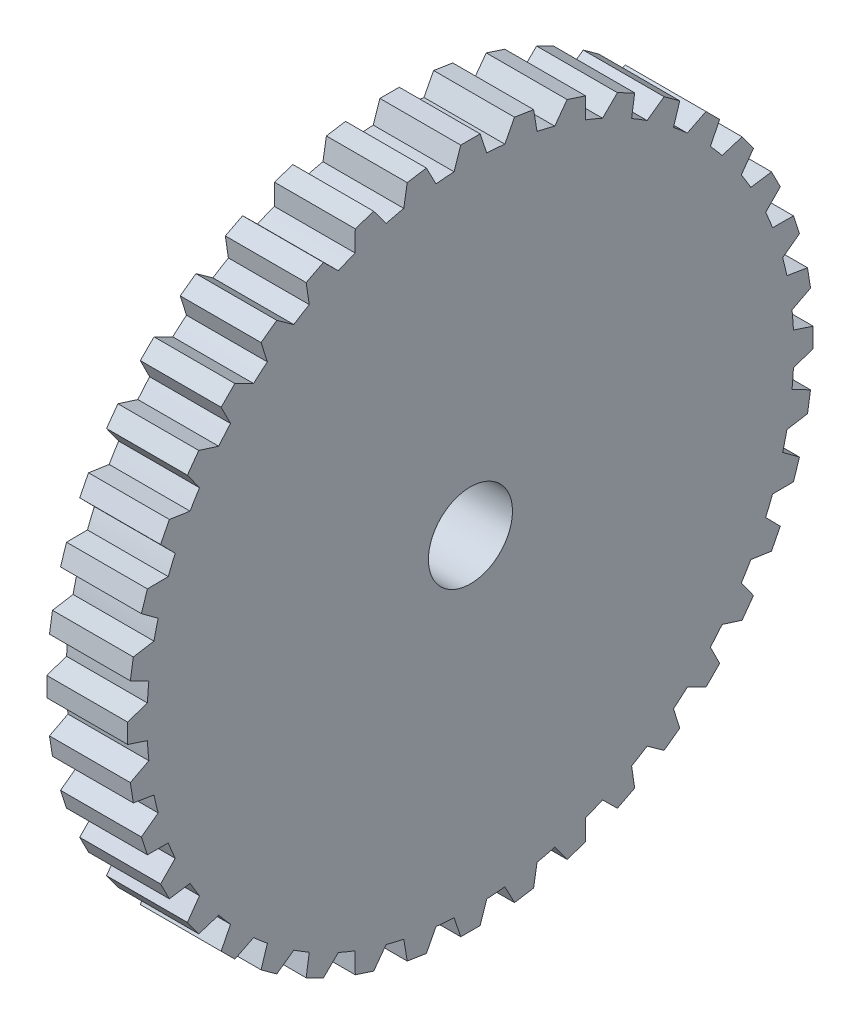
from build123d import *

# Parameters (mm, degrees)
SKETCH1_R           = 12.7
BOSS_EXTRUDE1_DEPTH = 3.175
BOSS_EXTRUDE2_DEPTH = 3.175
SKETCH3_R           = 1.651
CUT_EXTRUDE1_DEPTH  = 3.175


with BuildPart() as part:
    # Sketch1 → Boss-Extrude1 (new body)
    with BuildSketch(Plane(origin=(0, 0, 0), x_dir=(0, 0, -1), z_dir=(1, 0, 0))):
        Circle(SKETCH1_R)
    extrude(amount=BOSS_EXTRUDE1_DEPTH)

    # Sketch2 → Boss-Extrude2 (add)
    with BuildSketch(Plane(origin=(3.175, 0, 0), x_dir=(0, 0, -1), z_dir=(1, 0, 0))):
        Polygon((1.729611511, 13.355861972), (2.482230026, 13.23665891), (2.67973469, 12.048129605), (1.174497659, 12.28653573), align=None)
        Polygon((-0.762, 12.319), (0.762, 12.319), (0.381, 13.462), (-0.381, 13.462), align=None)
        Polygon((3.797634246, 12.920858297), (4.522339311, 12.685387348), (4.531485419, 11.480594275), (3.082075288, 11.951536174), align=None)
        Polygon((5.772146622, 12.167700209), (6.451093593, 11.821759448), (6.271655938, 10.630368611), (4.913761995, 11.322250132), align=None)
        Polygon((7.604529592, 11.114932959), (8.221000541, 10.667040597), (7.857397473, 9.518387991), (6.624455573, 10.414172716), align=None)
        Polygon((9.249663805, 9.788479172), (9.788479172, 9.249663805), (9.249663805, 8.17203307), (8.17203307, 9.249663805), align=None)
        Polygon((10.667040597, 8.221000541), (11.114932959, 7.604529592), (10.414172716, 6.624455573), (9.518387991, 7.857397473), align=None)
        Polygon((11.821759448, 6.451093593), (12.167700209, 5.772146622), (11.322250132, 4.913761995), (10.630368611, 6.271655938), align=None)
        Polygon((12.685387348, 4.522339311), (12.920858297, 3.797634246), (11.951536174, 3.082075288), (11.480594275, 4.531485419), align=None)
        Polygon((13.23665891, 2.482230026), (13.355861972, 1.729611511), (12.28653573, 1.174497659), (12.048129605, 2.67973469), align=None)
        Polygon((13.462, 0.381), (13.462, -0.381), (12.319, -0.762), (12.319, 0.762), align=None)
        Polygon((13.355861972, -1.729611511), (13.23665891, -2.482230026), (12.048129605, -2.67973469), (12.28653573, -1.174497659), align=None)
        Polygon((12.920858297, -3.797634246), (12.685387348, -4.522339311), (11.480594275, -4.531485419), (11.951536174, -3.082075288), align=None)
        Polygon((12.167700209, -5.772146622), (11.821759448, -6.451093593), (10.630368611, -6.271655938), (11.322250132, -4.913761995), align=None)
        Polygon((11.114932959, -7.604529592), (10.667040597, -8.221000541), (9.518387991, -7.857397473), (10.414172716, -6.624455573), align=None)
        Polygon((9.788479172, -9.249663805), (9.249663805, -9.788479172), (8.17203307, -9.249663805), (9.249663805, -8.17203307), align=None)
        Polygon((8.221000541, -10.667040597), (7.604529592, -11.114932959), (6.624455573, -10.414172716), (7.857397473, -9.518387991), align=None)
        Polygon((6.451093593, -11.821759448), (5.772146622, -12.167700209), (4.913761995, -11.322250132), (6.271655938, -10.630368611), align=None)
        Polygon((4.522339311, -12.685387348), (3.797634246, -12.920858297), (3.082075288, -11.951536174), (4.531485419, -11.480594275), align=None)
        Polygon((2.482230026, -13.23665891), (1.729611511, -13.355861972), (1.174497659, -12.28653573), (2.67973469, -12.048129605), align=None)
        Polygon((0.381, -13.462), (-0.381, -13.462), (-0.762, -12.319), (0.762, -12.319), align=None)
        Polygon((-1.729611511, -13.355861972), (-2.482230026, -13.23665891), (-2.67973469, -12.048129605), (-1.174497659, -12.28653573), align=None)
        Polygon((-3.797634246, -12.920858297), (-4.522339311, -12.685387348), (-4.531485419, -11.480594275), (-3.082075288, -11.951536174), align=None)
        Polygon((-5.772146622, -12.167700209), (-6.451093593, -11.821759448), (-6.271655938, -10.630368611), (-4.913761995, -11.322250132), align=None)
        Polygon((-7.604529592, -11.114932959), (-8.221000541, -10.667040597), (-7.857397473, -9.518387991), (-6.624455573, -10.414172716), align=None)
        Polygon((-9.249663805, -9.788479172), (-9.788479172, -9.249663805), (-9.249663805, -8.17203307), (-8.17203307, -9.249663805), align=None)
        Polygon((-10.667040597, -8.221000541), (-11.114932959, -7.604529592), (-10.414172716, -6.624455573), (-9.518387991, -7.857397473), align=None)
        Polygon((-11.821759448, -6.451093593), (-12.167700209, -5.772146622), (-11.322250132, -4.913761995), (-10.630368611, -6.271655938), align=None)
        Polygon((-12.685387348, -4.522339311), (-12.920858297, -3.797634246), (-11.951536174, -3.082075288), (-11.480594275, -4.531485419), align=None)
        Polygon((-13.23665891, -2.482230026), (-13.355861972, -1.729611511), (-12.28653573, -1.174497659), (-12.048129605, -2.67973469), align=None)
        Polygon((-13.462, -0.381), (-13.462, 0.381), (-12.319, 0.762), (-12.319, -0.762), align=None)
        Polygon((-13.355861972, 1.729611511), (-13.23665891, 2.482230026), (-12.048129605, 2.67973469), (-12.28653573, 1.174497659), align=None)
        Polygon((-12.920858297, 3.797634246), (-12.685387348, 4.522339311), (-11.480594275, 4.531485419), (-11.951536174, 3.082075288), align=None)
        Polygon((-12.167700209, 5.772146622), (-11.821759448, 6.451093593), (-10.630368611, 6.271655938), (-11.322250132, 4.913761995), align=None)
        Polygon((-11.114932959, 7.604529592), (-10.667040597, 8.221000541), (-9.518387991, 7.857397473), (-10.414172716, 6.624455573), align=None)
        Polygon((-9.788479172, 9.249663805), (-9.249663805, 9.788479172), (-8.17203307, 9.249663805), (-9.249663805, 8.17203307), align=None)
        Polygon((-8.221000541, 10.667040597), (-7.604529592, 11.114932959), (-6.624455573, 10.414172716), (-7.857397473, 9.518387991), align=None)
        Polygon((-6.451093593, 11.821759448), (-5.772146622, 12.167700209), (-4.913761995, 11.322250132), (-6.271655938, 10.630368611), align=None)
        Polygon((-4.522339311, 12.685387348), (-3.797634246, 12.920858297), (-3.082075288, 11.951536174), (-4.531485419, 11.480594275), align=None)
        Polygon((-2.482230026, 13.23665891), (-1.729611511, 13.355861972), (-1.174497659, 12.28653573), (-2.67973469, 12.048129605), align=None)
    extrude(amount=-BOSS_EXTRUDE2_DEPTH)

    # Sketch3 → Cut-Extrude1 (cut)
    with BuildSketch(Plane(origin=(3.175, 0, 0), x_dir=(0, 0, -1), z_dir=(1, 0, 0))):
        Circle(SKETCH3_R)
    extrude(amount=-CUT_EXTRUDE1_DEPTH, mode=Mode.SUBTRACT)


solid = part.part
